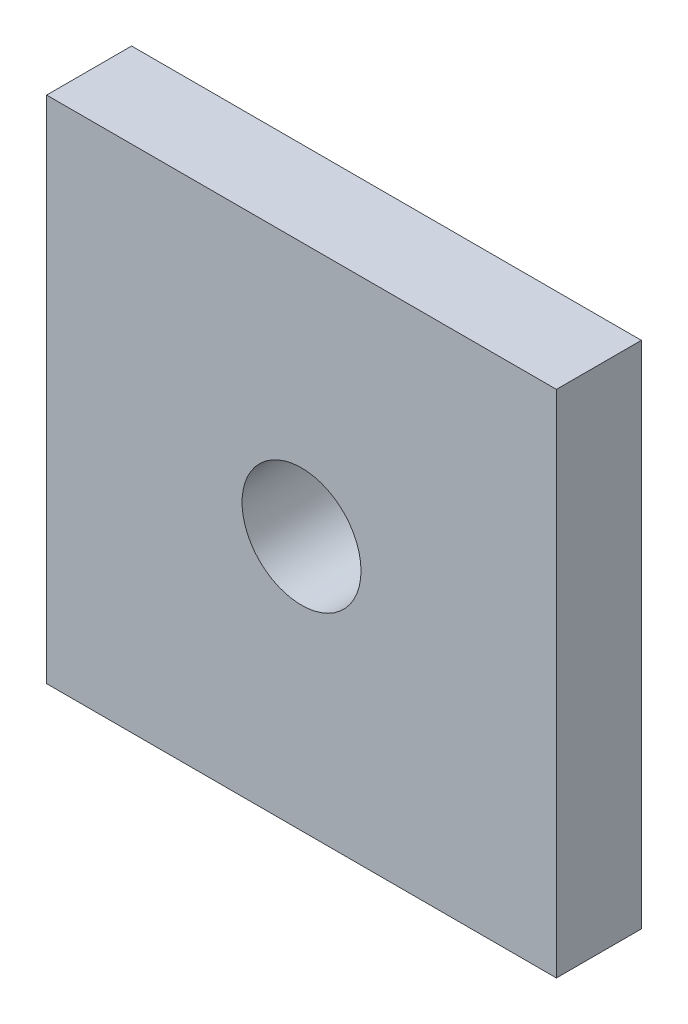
ISO-10303-21;
HEADER;
FILE_DESCRIPTION(('STEP AP214'),'2;1');
FILE_NAME('part.step','',(''),(''),'','','');
FILE_SCHEMA(('AUTOMOTIVE_DESIGN { 1 0 10303 214 1 1 1 1 }'));
ENDSEC;
DATA;
#1=APPLICATION_CONTEXT('core data for automotive mechanical design processes');
#2=APPLICATION_PROTOCOL_DEFINITION('international standard','automotive_design',2000,#1);
#3=PRODUCT_CONTEXT('',#1,'mechanical');
#4=PRODUCT('Part','Part','',(#3));
#5=PRODUCT_RELATED_PRODUCT_CATEGORY('part','',(#4));
#6=PRODUCT_DEFINITION_FORMATION('','',#4);
#7=PRODUCT_DEFINITION_CONTEXT('part definition',#1,'design');
#8=PRODUCT_DEFINITION('design','',#6,#7);
#9=PRODUCT_DEFINITION_SHAPE('','',#8);
#10=(LENGTH_UNIT() NAMED_UNIT(*) SI_UNIT(.MILLI.,.METRE.));
#11=(NAMED_UNIT(*) PLANE_ANGLE_UNIT() SI_UNIT($,.RADIAN.));
#12=(NAMED_UNIT(*) SI_UNIT($,.STERADIAN.) SOLID_ANGLE_UNIT());
#13=UNCERTAINTY_MEASURE_WITH_UNIT(LENGTH_MEASURE(1.E-05),#10,'distance_accuracy_value','');
#14=(GEOMETRIC_REPRESENTATION_CONTEXT(3) GLOBAL_UNCERTAINTY_ASSIGNED_CONTEXT((#13)) GLOBAL_UNIT_ASSIGNED_CONTEXT((#10,
#11,#12)) REPRESENTATION_CONTEXT('',''));
#15=CARTESIAN_POINT('',(0.,0.,0.));
#16=DIRECTION('',(0.,0.,1.));
#17=DIRECTION('',(1.,0.,0.));
#18=AXIS2_PLACEMENT_3D('',#15,#16,#17);
#19=CARTESIAN_POINT('',(0.,0.,10.));
#20=DIRECTION('',(1.,0.,0.));
#21=DIRECTION('',(0.,0.,-1.));
#22=AXIS2_PLACEMENT_3D('',#19,#20,#21);
#23=PLANE('',#22);
#24=DIRECTION('',(0.,-1.,0.));
#25=VECTOR('',#24,1.);
#26=CARTESIAN_POINT('',(0.,0.,0.));
#27=LINE('',#26,#25);
#28=CARTESIAN_POINT('',(0.,60.,0.));
#29=VERTEX_POINT('',#28);
#30=CARTESIAN_POINT('',(0.,0.,0.));
#31=VERTEX_POINT('',#30);
#32=EDGE_CURVE('E96',#29,#31,#27,.T.);
#33=ORIENTED_EDGE('',*,*,#32,.T.);
#34=DIRECTION('',(0.,0.,-1.));
#35=VECTOR('',#34,1.);
#36=CARTESIAN_POINT('',(0.,0.,10.));
#37=LINE('',#36,#35);
#38=CARTESIAN_POINT('',(0.,0.,10.));
#39=VERTEX_POINT('',#38);
#40=EDGE_CURVE('E11',#39,#31,#37,.T.);
#41=ORIENTED_EDGE('',*,*,#40,.F.);
#42=DIRECTION('',(0.,-1.,0.));
#43=VECTOR('',#42,1.);
#44=CARTESIAN_POINT('',(0.,0.,10.));
#45=LINE('',#44,#43);
#46=CARTESIAN_POINT('',(0.,60.,10.));
#47=VERTEX_POINT('',#46);
#48=EDGE_CURVE('E84',#47,#39,#45,.T.);
#49=ORIENTED_EDGE('',*,*,#48,.F.);
#50=DIRECTION('',(0.,0.,-1.));
#51=VECTOR('',#50,1.);
#52=CARTESIAN_POINT('',(0.,60.,10.));
#53=LINE('',#52,#51);
#54=EDGE_CURVE('E92',#47,#29,#53,.T.);
#55=ORIENTED_EDGE('',*,*,#54,.T.);
#56=EDGE_LOOP('',(#33,#41,#49,#55));
#57=FACE_BOUND('',#56,.T.);
#58=ADVANCED_FACE('F33',(#57),#23,.F.);
#59=CARTESIAN_POINT('',(0.,0.,10.));
#60=DIRECTION('',(0.,1.,0.));
#61=DIRECTION('',(0.,0.,1.));
#62=AXIS2_PLACEMENT_3D('',#59,#60,#61);
#63=PLANE('',#62);
#64=DIRECTION('',(1.,0.,0.));
#65=VECTOR('',#64,1.);
#66=CARTESIAN_POINT('',(0.,0.,0.));
#67=LINE('',#66,#65);
#68=CARTESIAN_POINT('',(60.,0.,0.));
#69=VERTEX_POINT('',#68);
#70=EDGE_CURVE('E88',#31,#69,#67,.T.);
#71=ORIENTED_EDGE('',*,*,#70,.T.);
#72=DIRECTION('',(0.,0.,-1.));
#73=VECTOR('',#72,1.);
#74=CARTESIAN_POINT('',(60.,0.,10.));
#75=LINE('',#74,#73);
#76=CARTESIAN_POINT('',(60.,0.,10.));
#77=VERTEX_POINT('',#76);
#78=EDGE_CURVE('E41',#77,#69,#75,.T.);
#79=ORIENTED_EDGE('',*,*,#78,.F.);
#80=DIRECTION('',(1.,0.,0.));
#81=VECTOR('',#80,1.);
#82=CARTESIAN_POINT('',(0.,0.,10.));
#83=LINE('',#82,#81);
#84=EDGE_CURVE('E79',#39,#77,#83,.T.);
#85=ORIENTED_EDGE('',*,*,#84,.F.);
#86=ORIENTED_EDGE('',*,*,#40,.T.);
#87=EDGE_LOOP('',(#71,#79,#85,#86));
#88=FACE_BOUND('',#87,.T.);
#89=ADVANCED_FACE('F87',(#88),#63,.F.);
#90=CARTESIAN_POINT('',(60.,0.,10.));
#91=DIRECTION('',(-1.,0.,0.));
#92=DIRECTION('',(0.,0.,1.));
#93=AXIS2_PLACEMENT_3D('',#90,#91,#92);
#94=PLANE('',#93);
#95=DIRECTION('',(0.,1.,0.));
#96=VECTOR('',#95,1.);
#97=CARTESIAN_POINT('',(60.,0.,0.));
#98=LINE('',#97,#96);
#99=CARTESIAN_POINT('',(60.,60.,0.));
#100=VERTEX_POINT('',#99);
#101=EDGE_CURVE('E66',#69,#100,#98,.T.);
#102=ORIENTED_EDGE('',*,*,#101,.T.);
#103=DIRECTION('',(0.,0.,-1.));
#104=VECTOR('',#103,1.);
#105=CARTESIAN_POINT('',(60.,60.,10.));
#106=LINE('',#105,#104);
#107=CARTESIAN_POINT('',(60.,60.,10.));
#108=VERTEX_POINT('',#107);
#109=EDGE_CURVE('E89',#108,#100,#106,.T.);
#110=ORIENTED_EDGE('',*,*,#109,.F.);
#111=DIRECTION('',(0.,1.,0.));
#112=VECTOR('',#111,1.);
#113=CARTESIAN_POINT('',(60.,0.,10.));
#114=LINE('',#113,#112);
#115=EDGE_CURVE('E82',#77,#108,#114,.T.);
#116=ORIENTED_EDGE('',*,*,#115,.F.);
#117=ORIENTED_EDGE('',*,*,#78,.T.);
#118=EDGE_LOOP('',(#102,#110,#116,#117));
#119=FACE_BOUND('',#118,.T.);
#120=ADVANCED_FACE('F90',(#119),#94,.F.);
#121=CARTESIAN_POINT('',(0.,60.,10.));
#122=DIRECTION('',(0.,-1.,0.));
#123=DIRECTION('',(0.,0.,-1.));
#124=AXIS2_PLACEMENT_3D('',#121,#122,#123);
#125=PLANE('',#124);
#126=DIRECTION('',(-1.,0.,0.));
#127=VECTOR('',#126,1.);
#128=CARTESIAN_POINT('',(0.,60.,0.));
#129=LINE('',#128,#127);
#130=EDGE_CURVE('E72',#100,#29,#129,.T.);
#131=ORIENTED_EDGE('',*,*,#130,.T.);
#132=ORIENTED_EDGE('',*,*,#54,.F.);
#133=DIRECTION('',(-1.,0.,0.));
#134=VECTOR('',#133,1.);
#135=CARTESIAN_POINT('',(0.,60.,10.));
#136=LINE('',#135,#134);
#137=EDGE_CURVE('E49',#108,#47,#136,.T.);
#138=ORIENTED_EDGE('',*,*,#137,.F.);
#139=ORIENTED_EDGE('',*,*,#109,.T.);
#140=EDGE_LOOP('',(#131,#132,#138,#139));
#141=FACE_BOUND('',#140,.T.);
#142=ADVANCED_FACE('F104',(#141),#125,.F.);
#143=CARTESIAN_POINT('',(0.,60.,10.));
#144=DIRECTION('',(0.,0.,-1.));
#145=DIRECTION('',(-1.,0.,0.));
#146=AXIS2_PLACEMENT_3D('',#143,#144,#145);
#147=PLANE('',#146);
#148=CARTESIAN_POINT('',(30.,30.,10.));
#149=DIRECTION('',(0.,0.,1.));
#150=DIRECTION('',(1.,0.,0.));
#151=AXIS2_PLACEMENT_3D('',#148,#149,#150);
#152=CIRCLE('',#151,7.);
#153=CARTESIAN_POINT('',(37.,30.,10.));
#154=VERTEX_POINT('',#153);
#155=EDGE_CURVE('E110',#154,#154,#152,.T.);
#156=ORIENTED_EDGE('',*,*,#155,.F.);
#157=EDGE_LOOP('',(#156));
#158=FACE_BOUND('',#157,.T.);
#159=ORIENTED_EDGE('',*,*,#48,.T.);
#160=ORIENTED_EDGE('',*,*,#84,.T.);
#161=ORIENTED_EDGE('',*,*,#115,.T.);
#162=ORIENTED_EDGE('',*,*,#137,.T.);
#163=EDGE_LOOP('',(#159,#160,#161,#162));
#164=FACE_BOUND('',#163,.T.);
#165=ADVANCED_FACE('F80',(#158,#164),#147,.F.);
#166=CARTESIAN_POINT('',(0.,60.,0.));
#167=DIRECTION('',(0.,0.,-1.));
#168=DIRECTION('',(-1.,0.,0.));
#169=AXIS2_PLACEMENT_3D('',#166,#167,#168);
#170=PLANE('',#169);
#171=CARTESIAN_POINT('',(30.,30.,0.));
#172=DIRECTION('',(0.,0.,1.));
#173=DIRECTION('',(1.,0.,0.));
#174=AXIS2_PLACEMENT_3D('',#171,#172,#173);
#175=CIRCLE('',#174,7.);
#176=CARTESIAN_POINT('',(37.,30.,0.));
#177=VERTEX_POINT('',#176);
#178=EDGE_CURVE('E99',#177,#177,#175,.T.);
#179=ORIENTED_EDGE('',*,*,#178,.T.);
#180=EDGE_LOOP('',(#179));
#181=FACE_BOUND('',#180,.T.);
#182=ORIENTED_EDGE('',*,*,#32,.F.);
#183=ORIENTED_EDGE('',*,*,#130,.F.);
#184=ORIENTED_EDGE('',*,*,#101,.F.);
#185=ORIENTED_EDGE('',*,*,#70,.F.);
#186=EDGE_LOOP('',(#182,#183,#184,#185));
#187=FACE_BOUND('',#186,.T.);
#188=ADVANCED_FACE('F107',(#181,#187),#170,.T.);
#189=CARTESIAN_POINT('',(30.,30.,0.));
#190=DIRECTION('',(0.,0.,1.));
#191=DIRECTION('',(1.,0.,0.));
#192=AXIS2_PLACEMENT_3D('',#189,#190,#191);
#193=CYLINDRICAL_SURFACE('',#192,7.);
#194=ORIENTED_EDGE('',*,*,#178,.F.);
#195=EDGE_LOOP('',(#194));
#196=FACE_BOUND('',#195,.T.);
#197=ORIENTED_EDGE('',*,*,#155,.T.);
#198=EDGE_LOOP('',(#197));
#199=FACE_BOUND('',#198,.T.);
#200=ADVANCED_FACE('F117',(#196,#199),#193,.F.);
#201=CLOSED_SHELL('',(#58,#89,#120,#142,#165,#188,#200));
#202=MANIFOLD_SOLID_BREP('B2',#201);
#203=ADVANCED_BREP_SHAPE_REPRESENTATION('',(#18,#202),#14);
#204=SHAPE_DEFINITION_REPRESENTATION(#9,#203);
ENDSEC;
END-ISO-10303-21;
